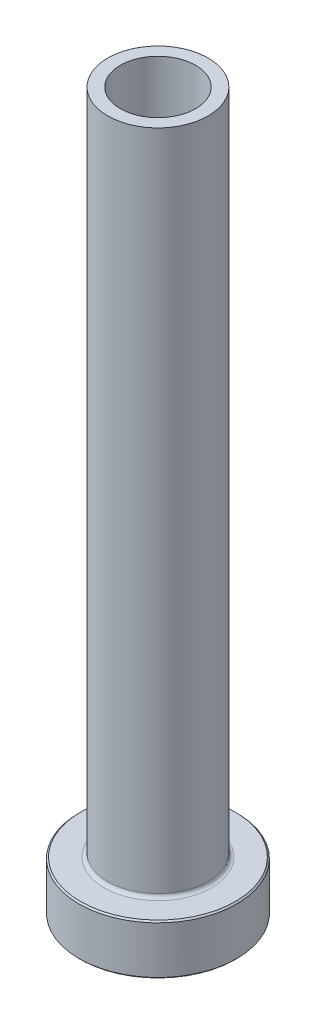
from build123d import *

# Parameters (mm, degrees)
FILLET1_R     = 0.5
CHAMFER1_SIZE = 0.2
CHAMFER3_SIZE = 0.5


with BuildPart() as part:
    # Sketch1 → Revolve1 (revolve)
    with BuildSketch(Plane.XY, mode=Mode.PRIVATE) as revolve1_sk:
        Polygon((-5.25, 100), (-7, 100), (-7, 7), (-11, 7), (-11, 0), (-5.5, 0), (-5.5, 33), (-5.25, 45), align=None)
    revolve(revolve1_sk.sketch.rotate(Axis((0, 92.187680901, 0), (0, -1, 0)), 270), axis=Axis((0, 92.187680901, 0), (0, -1, 0)))

    # Fillet1
    fillet1_edges = [part.edges().sort_by_distance(p)[0] for p in [
        (0, 7, -7),
    ]]
    fillet(fillet1_edges, radius=FILLET1_R)

    # Chamfer1
    chamfer1_edges = [part.edges().sort_by_distance(p)[0] for p in [
        (0, 0, -11),
        (0, 7, -11),
    ]]
    chamfer(chamfer1_edges, length=CHAMFER1_SIZE)

    # Chamfer3
    chamfer3_edges = [part.edges().sort_by_distance(p)[0] for p in [
        (0, 0, -5.5),
    ]]
    chamfer(chamfer3_edges, length=CHAMFER3_SIZE)


solid = part.part
